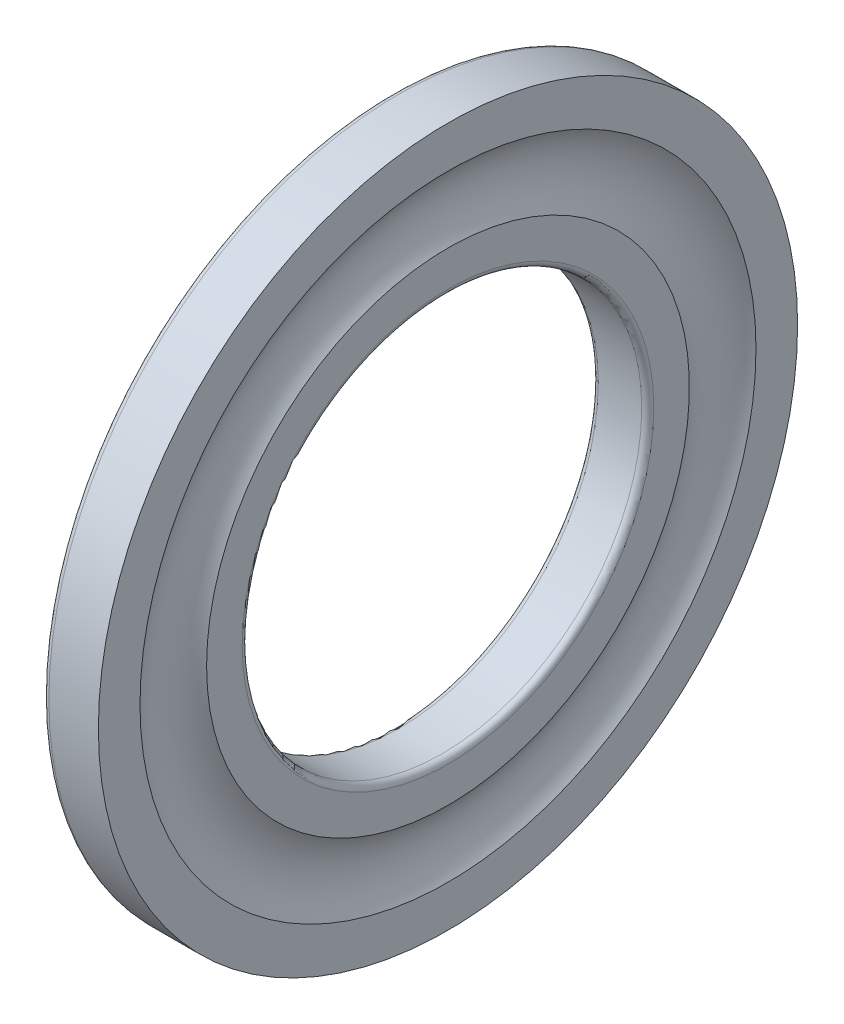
ISO-10303-21;
HEADER;
FILE_DESCRIPTION(('STEP AP214'),'2;1');
FILE_NAME('part.step','',(''),(''),'','','');
FILE_SCHEMA(('AUTOMOTIVE_DESIGN { 1 0 10303 214 1 1 1 1 }'));
ENDSEC;
DATA;
#1=APPLICATION_CONTEXT('core data for automotive mechanical design processes');
#2=APPLICATION_PROTOCOL_DEFINITION('international standard','automotive_design',2000,#1);
#3=PRODUCT_CONTEXT('',#1,'mechanical');
#4=PRODUCT('Part','Part','',(#3));
#5=PRODUCT_RELATED_PRODUCT_CATEGORY('part','',(#4));
#6=PRODUCT_DEFINITION_FORMATION('','',#4);
#7=PRODUCT_DEFINITION_CONTEXT('part definition',#1,'design');
#8=PRODUCT_DEFINITION('design','',#6,#7);
#9=PRODUCT_DEFINITION_SHAPE('','',#8);
#10=(LENGTH_UNIT() NAMED_UNIT(*) SI_UNIT(.MILLI.,.METRE.));
#11=(NAMED_UNIT(*) PLANE_ANGLE_UNIT() SI_UNIT($,.RADIAN.));
#12=(NAMED_UNIT(*) SI_UNIT($,.STERADIAN.) SOLID_ANGLE_UNIT());
#13=UNCERTAINTY_MEASURE_WITH_UNIT(LENGTH_MEASURE(1.E-05),#10,'distance_accuracy_value','');
#14=(GEOMETRIC_REPRESENTATION_CONTEXT(3) GLOBAL_UNCERTAINTY_ASSIGNED_CONTEXT((#13)) GLOBAL_UNIT_ASSIGNED_CONTEXT((#10,
#11,#12)) REPRESENTATION_CONTEXT('',''));
#15=CARTESIAN_POINT('',(0.,0.,0.));
#16=DIRECTION('',(0.,0.,1.));
#17=DIRECTION('',(1.,0.,0.));
#18=AXIS2_PLACEMENT_3D('',#15,#16,#17);
#19=CARTESIAN_POINT('',(0.,-17.5195131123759,-17.2));
#20=DIRECTION('',(-1.,0.,0.));
#21=DIRECTION('',(0.,0.,1.));
#22=AXIS2_PLACEMENT_3D('',#19,#20,#21);
#23=PLANE('',#22);
#24=CARTESIAN_POINT('',(0.,0.,0.));
#25=DIRECTION('',(-1.,0.,0.));
#26=DIRECTION('',(0.,0.,-1.));
#27=AXIS2_PLACEMENT_3D('',#24,#25,#26);
#28=CIRCLE('',#27,17.2000000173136);
#29=CARTESIAN_POINT('',(0.,0.,-17.2000000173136));
#30=VERTEX_POINT('',#29);
#31=EDGE_CURVE('E47',#30,#30,#28,.F.);
#32=ORIENTED_EDGE('',*,*,#31,.F.);
#33=EDGE_LOOP('',(#32));
#34=FACE_BOUND('',#33,.T.);
#35=CARTESIAN_POINT('',(0.,0.,0.));
#36=DIRECTION('',(1.,0.,0.));
#37=DIRECTION('',(0.,0.,1.));
#38=AXIS2_PLACEMENT_3D('',#35,#36,#37);
#39=CIRCLE('',#38,10.3);
#40=CARTESIAN_POINT('',(0.,0.,10.3));
#41=VERTEX_POINT('',#40);
#42=EDGE_CURVE('E44',#41,#41,#39,.T.);
#43=ORIENTED_EDGE('',*,*,#42,.T.);
#44=EDGE_LOOP('',(#43));
#45=FACE_BOUND('',#44,.T.);
#46=ADVANCED_FACE('F15',(#34,#45),#23,.T.);
#47=CARTESIAN_POINT('',(2.7776,-12.4133608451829,12.0832));
#48=DIRECTION('',(1.,0.,0.));
#49=DIRECTION('',(0.,0.,-1.));
#50=AXIS2_PLACEMENT_3D('',#47,#48,#49);
#51=PLANE('',#50);
#52=CARTESIAN_POINT('',(2.7776,0.,0.));
#53=DIRECTION('',(1.,0.,0.));
#54=DIRECTION('',(0.,0.,1.));
#55=AXIS2_PLACEMENT_3D('',#52,#53,#54);
#56=CIRCLE('',#55,12.0832);
#57=CARTESIAN_POINT('',(2.7776,0.,12.0832));
#58=VERTEX_POINT('',#57);
#59=EDGE_CURVE('E41',#58,#58,#56,.T.);
#60=ORIENTED_EDGE('',*,*,#59,.T.);
#61=EDGE_LOOP('',(#60));
#62=FACE_BOUND('',#61,.T.);
#63=CARTESIAN_POINT('',(2.7776,0.,0.));
#64=DIRECTION('',(-1.,0.,0.));
#65=DIRECTION('',(0.,0.,-1.));
#66=AXIS2_PLACEMENT_3D('',#63,#64,#65);
#67=CIRCLE('',#66,10.3000000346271);
#68=CARTESIAN_POINT('',(2.7776,0.,-10.3000000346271));
#69=VERTEX_POINT('',#68);
#70=EDGE_CURVE('E38',#69,#69,#67,.F.);
#71=ORIENTED_EDGE('',*,*,#70,.F.);
#72=EDGE_LOOP('',(#71));
#73=FACE_BOUND('',#72,.T.);
#74=ADVANCED_FACE('F55',(#62,#73),#51,.T.);
#75=CARTESIAN_POINT('',(2.7776,-17.8250860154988,17.5));
#76=DIRECTION('',(1.,0.,0.));
#77=DIRECTION('',(0.,0.,-1.));
#78=AXIS2_PLACEMENT_3D('',#75,#76,#77);
#79=PLANE('',#78);
#80=CARTESIAN_POINT('',(2.7776,0.,0.));
#81=DIRECTION('',(1.,0.,0.));
#82=DIRECTION('',(0.,0.,1.));
#83=AXIS2_PLACEMENT_3D('',#80,#81,#82);
#84=CIRCLE('',#83,17.5);
#85=CARTESIAN_POINT('',(2.7776,0.,17.5));
#86=VERTEX_POINT('',#85);
#87=EDGE_CURVE('E35',#86,#86,#84,.T.);
#88=ORIENTED_EDGE('',*,*,#87,.T.);
#89=EDGE_LOOP('',(#88));
#90=FACE_BOUND('',#89,.T.);
#91=CARTESIAN_POINT('',(2.7776,0.,0.));
#92=DIRECTION('',(-1.,0.,0.));
#93=DIRECTION('',(0.,0.,-1.));
#94=AXIS2_PLACEMENT_3D('',#91,#92,#93);
#95=CIRCLE('',#94,15.4168);
#96=CARTESIAN_POINT('',(2.7776,0.,-15.4168));
#97=VERTEX_POINT('',#96);
#98=EDGE_CURVE('E30',#97,#97,#95,.F.);
#99=ORIENTED_EDGE('',*,*,#98,.F.);
#100=EDGE_LOOP('',(#99));
#101=FACE_BOUND('',#100,.T.);
#102=ADVANCED_FACE('F62',(#90,#101),#79,.T.);
#103=CARTESIAN_POINT('',(0.299999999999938,0.,0.));
#104=DIRECTION('',(1.,0.,0.));
#105=DIRECTION('',(0.,0.,1.));
#106=AXIS2_PLACEMENT_3D('',#103,#104,#105);
#107=TOROIDAL_SURFACE('',#106,10.3,0.299999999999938);
#108=CARTESIAN_POINT('',(0.3,0.,0.));
#109=DIRECTION('',(1.,0.,0.));
#110=DIRECTION('',(0.,0.,1.));
#111=AXIS2_PLACEMENT_3D('',#108,#109,#110);
#112=CIRCLE('',#111,10.0000000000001);
#113=CARTESIAN_POINT('',(0.3,0.,10.0000000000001));
#114=VERTEX_POINT('',#113);
#115=EDGE_CURVE('E26',#114,#114,#112,.T.);
#116=ORIENTED_EDGE('',*,*,#115,.T.);
#117=EDGE_LOOP('',(#116));
#118=FACE_BOUND('',#117,.T.);
#119=ORIENTED_EDGE('',*,*,#42,.F.);
#120=EDGE_LOOP('',(#119));
#121=FACE_BOUND('',#120,.T.);
#122=ADVANCED_FACE('F59',(#118,#121),#107,.T.);
#123=CARTESIAN_POINT('',(2.7776,0.,0.));
#124=DIRECTION('',(1.,0.,0.));
#125=DIRECTION('',(0.,0.,1.));
#126=AXIS2_PLACEMENT_3D('',#123,#124,#125);
#127=CYLINDRICAL_SURFACE('',#126,10.);
#128=CARTESIAN_POINT('',(2.4776,0.,0.));
#129=DIRECTION('',(1.,0.,0.));
#130=DIRECTION('',(0.,0.,1.));
#131=AXIS2_PLACEMENT_3D('',#128,#129,#130);
#132=CIRCLE('',#131,10.);
#133=CARTESIAN_POINT('',(2.4776,0.,10.));
#134=VERTEX_POINT('',#133);
#135=EDGE_CURVE('E22',#134,#134,#132,.T.);
#136=ORIENTED_EDGE('',*,*,#135,.T.);
#137=EDGE_LOOP('',(#136));
#138=FACE_BOUND('',#137,.T.);
#139=ORIENTED_EDGE('',*,*,#115,.F.);
#140=EDGE_LOOP('',(#139));
#141=FACE_BOUND('',#140,.T.);
#142=ADVANCED_FACE('F61',(#138,#141),#127,.F.);
#143=CARTESIAN_POINT('',(2.47760000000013,0.,0.));
#144=DIRECTION('',(1.,0.,0.));
#145=DIRECTION('',(0.,0.,1.));
#146=AXIS2_PLACEMENT_3D('',#143,#144,#145);
#147=TOROIDAL_SURFACE('',#146,10.2999999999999,0.299999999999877);
#148=ORIENTED_EDGE('',*,*,#70,.T.);
#149=EDGE_LOOP('',(#148));
#150=FACE_BOUND('',#149,.T.);
#151=ORIENTED_EDGE('',*,*,#135,.F.);
#152=EDGE_LOOP('',(#151));
#153=FACE_BOUND('',#152,.T.);
#154=ADVANCED_FACE('F70',(#150,#153),#147,.T.);
#155=CARTESIAN_POINT('',(5.,0.,0.));
#156=DIRECTION('',(1.,0.,0.));
#157=DIRECTION('',(0.,0.,1.));
#158=AXIS2_PLACEMENT_3D('',#155,#156,#157);
#159=TOROIDAL_SURFACE('',#158,13.75,2.778);
#160=ORIENTED_EDGE('',*,*,#59,.F.);
#161=EDGE_LOOP('',(#160));
#162=FACE_BOUND('',#161,.T.);
#163=ORIENTED_EDGE('',*,*,#98,.T.);
#164=EDGE_LOOP('',(#163));
#165=FACE_BOUND('',#164,.T.);
#166=ADVANCED_FACE('F78',(#162,#165),#159,.F.);
#167=CARTESIAN_POINT('',(2.7776,0.,0.));
#168=DIRECTION('',(1.,0.,0.));
#169=DIRECTION('',(0.,0.,1.));
#170=AXIS2_PLACEMENT_3D('',#167,#168,#169);
#171=CYLINDRICAL_SURFACE('',#170,17.5);
#172=CARTESIAN_POINT('',(0.3,0.,0.));
#173=DIRECTION('',(1.,0.,0.));
#174=DIRECTION('',(0.,0.,1.));
#175=AXIS2_PLACEMENT_3D('',#172,#173,#174);
#176=CIRCLE('',#175,17.5);
#177=CARTESIAN_POINT('',(0.3,0.,17.5));
#178=VERTEX_POINT('',#177);
#179=EDGE_CURVE('E10',#178,#178,#176,.T.);
#180=ORIENTED_EDGE('',*,*,#179,.T.);
#181=EDGE_LOOP('',(#180));
#182=FACE_BOUND('',#181,.T.);
#183=ORIENTED_EDGE('',*,*,#87,.F.);
#184=EDGE_LOOP('',(#183));
#185=FACE_BOUND('',#184,.T.);
#186=ADVANCED_FACE('F81',(#182,#185),#171,.T.);
#187=CARTESIAN_POINT('',(0.299999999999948,0.,0.));
#188=DIRECTION('',(1.,0.,0.));
#189=DIRECTION('',(0.,0.,1.));
#190=AXIS2_PLACEMENT_3D('',#187,#188,#189);
#191=TOROIDAL_SURFACE('',#190,17.2,0.29999999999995);
#192=ORIENTED_EDGE('',*,*,#31,.T.);
#193=EDGE_LOOP('',(#192));
#194=FACE_BOUND('',#193,.T.);
#195=ORIENTED_EDGE('',*,*,#179,.F.);
#196=EDGE_LOOP('',(#195));
#197=FACE_BOUND('',#196,.T.);
#198=ADVANCED_FACE('F17',(#194,#197),#191,.T.);
#199=CLOSED_SHELL('',(#46,#74,#102,#122,#142,#154,#166,#186,#198));
#200=MANIFOLD_SOLID_BREP('B1',#199);
#201=ADVANCED_BREP_SHAPE_REPRESENTATION('',(#18,#200),#14);
#202=SHAPE_DEFINITION_REPRESENTATION(#9,#201);
ENDSEC;
END-ISO-10303-21;
